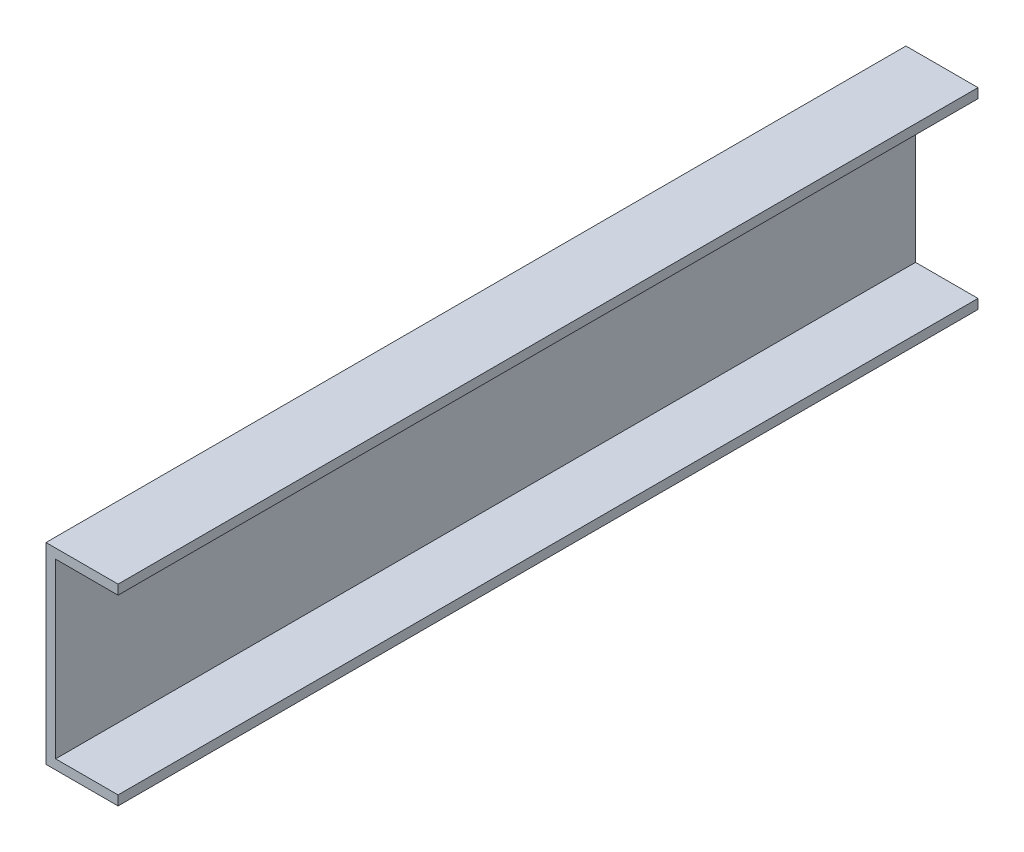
from build123d import *

# Parameters (mm, degrees)
BOSS_EXTRUDE1_DEPTH = 447.5


with BuildPart() as part:
    # Sketch1 → Boss-Extrude1 (new, symmetric)
    with BuildSketch(Plane.XY):
        Polygon((75, 0), (0, 0), (0, 200), (75, 200), (75, 190), (10, 190), (10, 10), (75, 10), align=None)
    extrude(amount=BOSS_EXTRUDE1_DEPTH, both=True)


solid = part.part
